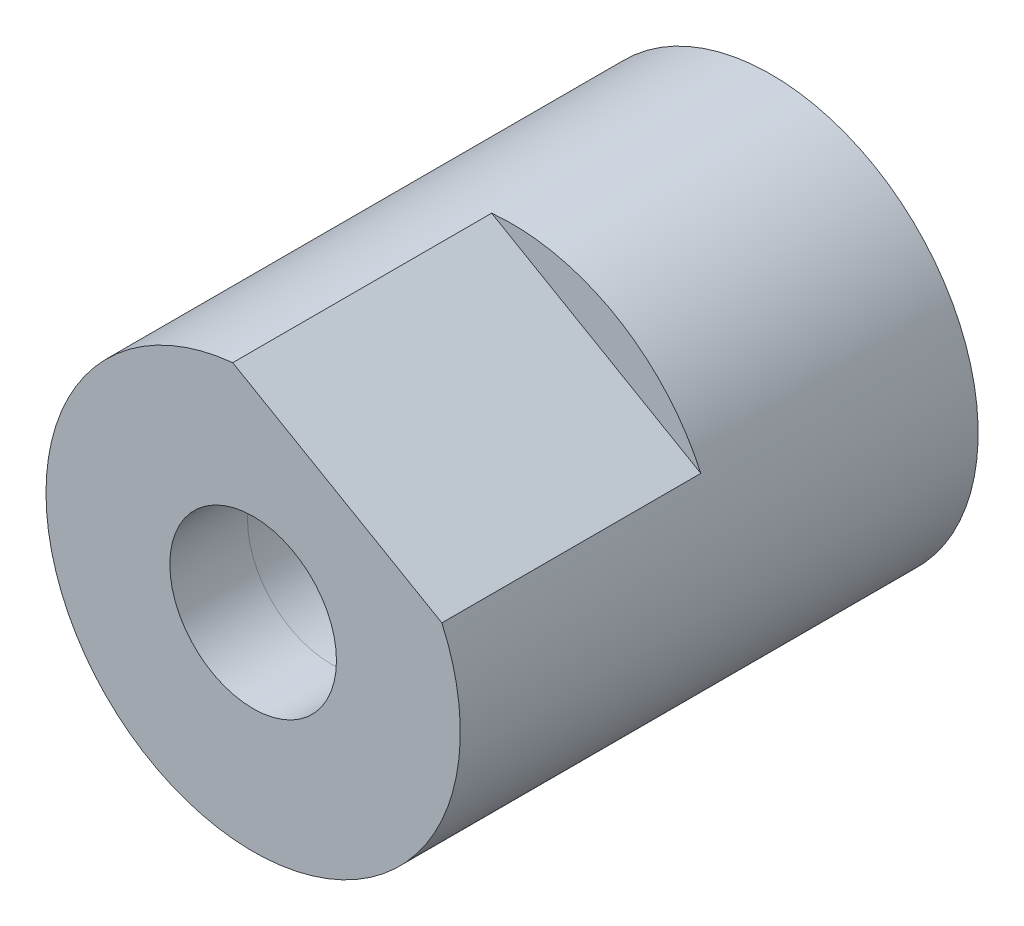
ISO-10303-21;
HEADER;
FILE_DESCRIPTION(('STEP AP214'),'2;1');
FILE_NAME('part.step','',(''),(''),'','','');
FILE_SCHEMA(('AUTOMOTIVE_DESIGN { 1 0 10303 214 1 1 1 1 }'));
ENDSEC;
DATA;
#1=APPLICATION_CONTEXT('core data for automotive mechanical design processes');
#2=APPLICATION_PROTOCOL_DEFINITION('international standard','automotive_design',2000,#1);
#3=PRODUCT_CONTEXT('',#1,'mechanical');
#4=PRODUCT('Part','Part','',(#3));
#5=PRODUCT_RELATED_PRODUCT_CATEGORY('part','',(#4));
#6=PRODUCT_DEFINITION_FORMATION('','',#4);
#7=PRODUCT_DEFINITION_CONTEXT('part definition',#1,'design');
#8=PRODUCT_DEFINITION('design','',#6,#7);
#9=PRODUCT_DEFINITION_SHAPE('','',#8);
#10=(LENGTH_UNIT() NAMED_UNIT(*) SI_UNIT(.MILLI.,.METRE.));
#11=(NAMED_UNIT(*) PLANE_ANGLE_UNIT() SI_UNIT($,.RADIAN.));
#12=(NAMED_UNIT(*) SI_UNIT($,.STERADIAN.) SOLID_ANGLE_UNIT());
#13=UNCERTAINTY_MEASURE_WITH_UNIT(LENGTH_MEASURE(1.E-05),#10,'distance_accuracy_value','');
#14=(GEOMETRIC_REPRESENTATION_CONTEXT(3) GLOBAL_UNCERTAINTY_ASSIGNED_CONTEXT((#13)) GLOBAL_UNIT_ASSIGNED_CONTEXT((#10,
#11,#12)) REPRESENTATION_CONTEXT('',''));
#15=CARTESIAN_POINT('',(0.,0.,0.));
#16=DIRECTION('',(0.,0.,1.));
#17=DIRECTION('',(1.,0.,0.));
#18=AXIS2_PLACEMENT_3D('',#15,#16,#17);
#19=CARTESIAN_POINT('',(-12.7,0.,0.));
#20=DIRECTION('',(0.,0.,1.));
#21=DIRECTION('',(1.,0.,0.));
#22=AXIS2_PLACEMENT_3D('',#19,#20,#21);
#23=PLANE('',#22);
#24=CARTESIAN_POINT('',(0.,0.,0.));
#25=DIRECTION('',(0.,0.,-1.));
#26=DIRECTION('',(-1.,0.,0.));
#27=AXIS2_PLACEMENT_3D('',#24,#25,#26);
#28=CIRCLE('',#27,6.20248949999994);
#29=CARTESIAN_POINT('',(-6.20248949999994,0.,0.));
#30=VERTEX_POINT('',#29);
#31=EDGE_CURVE('E90',#30,#30,#28,.T.);
#32=ORIENTED_EDGE('',*,*,#31,.F.);
#33=EDGE_LOOP('',(#32));
#34=FACE_BOUND('',#33,.T.);
#35=CARTESIAN_POINT('',(0.,0.,0.));
#36=DIRECTION('',(0.,0.,-1.));
#37=DIRECTION('',(-1.,0.,0.));
#38=AXIS2_PLACEMENT_3D('',#35,#36,#37);
#39=CIRCLE('',#38,12.7);
#40=CARTESIAN_POINT('',(-12.7,0.,0.));
#41=VERTEX_POINT('',#40);
#42=EDGE_CURVE('E11',#41,#41,#39,.T.);
#43=ORIENTED_EDGE('',*,*,#42,.T.);
#44=EDGE_LOOP('',(#43));
#45=FACE_BOUND('',#44,.T.);
#46=ADVANCED_FACE('F51',(#34,#45),#23,.F.);
#47=CARTESIAN_POINT('',(0.,0.,-41.5372037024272));
#48=DIRECTION('',(0.,0.,-1.));
#49=DIRECTION('',(-1.,0.,0.));
#50=AXIS2_PLACEMENT_3D('',#47,#48,#49);
#51=CYLINDRICAL_SURFACE('',#50,12.7);
#52=CARTESIAN_POINT('',(0.,0.,31.75));
#53=DIRECTION('',(0.,0.,-1.));
#54=DIRECTION('',(-1.,0.,0.));
#55=AXIS2_PLACEMENT_3D('',#52,#53,#54);
#56=CIRCLE('',#55,12.7);
#57=CARTESIAN_POINT('',(11.5710868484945,5.234496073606,31.75));
#58=VERTEX_POINT('',#57);
#59=CARTESIAN_POINT('',(-1.25233684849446,12.6381031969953,31.75));
#60=VERTEX_POINT('',#59);
#61=EDGE_CURVE('E59',#58,#60,#56,.T.);
#62=ORIENTED_EDGE('',*,*,#61,.T.);
#63=DIRECTION('',(0.,0.,1.));
#64=VECTOR('',#63,1.);
#65=CARTESIAN_POINT('',(-1.25233684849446,12.6381031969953,15.875));
#66=LINE('',#65,#64);
#67=CARTESIAN_POINT('',(-1.25233684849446,12.6381031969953,15.875));
#68=VERTEX_POINT('',#67);
#69=EDGE_CURVE('E66',#68,#60,#66,.T.);
#70=ORIENTED_EDGE('',*,*,#69,.F.);
#71=CARTESIAN_POINT('',(0.,0.,15.875));
#72=DIRECTION('',(0.,0.,1.));
#73=DIRECTION('',(1.,0.,0.));
#74=AXIS2_PLACEMENT_3D('',#71,#72,#73);
#75=CIRCLE('',#74,12.7);
#76=CARTESIAN_POINT('',(11.5710868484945,5.234496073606,15.875));
#77=VERTEX_POINT('',#76);
#78=EDGE_CURVE('E83',#77,#68,#75,.T.);
#79=ORIENTED_EDGE('',*,*,#78,.F.);
#80=DIRECTION('',(0.,0.,1.));
#81=VECTOR('',#80,1.);
#82=CARTESIAN_POINT('',(11.5710868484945,5.234496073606,15.875));
#83=LINE('',#82,#81);
#84=EDGE_CURVE('E72',#77,#58,#83,.T.);
#85=ORIENTED_EDGE('',*,*,#84,.T.);
#86=EDGE_LOOP('',(#62,#70,#79,#85));
#87=FACE_BOUND('',#86,.T.);
#88=ORIENTED_EDGE('',*,*,#42,.F.);
#89=EDGE_LOOP('',(#88));
#90=FACE_BOUND('',#89,.T.);
#91=ADVANCED_FACE('F87',(#87,#90),#51,.T.);
#92=CARTESIAN_POINT('',(-5.10794000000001,0.,31.75));
#93=DIRECTION('',(0.,0.,-1.));
#94=DIRECTION('',(-1.,0.,0.));
#95=AXIS2_PLACEMENT_3D('',#92,#93,#94);
#96=PLANE('',#95);
#97=ORIENTED_EDGE('',*,*,#61,.F.);
#98=DIRECTION('',(0.866025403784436,-0.500000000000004,0.));
#99=VECTOR('',#98,1.);
#100=CARTESIAN_POINT('',(-1.25233684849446,12.6381031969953,31.75));
#101=LINE('',#100,#99);
#102=EDGE_CURVE('E77',#60,#58,#101,.T.);
#103=ORIENTED_EDGE('',*,*,#102,.F.);
#104=EDGE_LOOP('',(#97,#103));
#105=FACE_BOUND('',#104,.T.);
#106=CARTESIAN_POINT('',(0.,0.,31.75));
#107=DIRECTION('',(0.,0.,-1.));
#108=DIRECTION('',(-1.,0.,0.));
#109=AXIS2_PLACEMENT_3D('',#106,#107,#108);
#110=CIRCLE('',#109,5.10794);
#111=CARTESIAN_POINT('',(-5.10794,0.,31.75));
#112=VERTEX_POINT('',#111);
#113=EDGE_CURVE('E95',#112,#112,#110,.T.);
#114=ORIENTED_EDGE('',*,*,#113,.T.);
#115=EDGE_LOOP('',(#114));
#116=FACE_BOUND('',#115,.T.);
#117=ADVANCED_FACE('F92',(#105,#116),#96,.F.);
#118=CARTESIAN_POINT('',(0.,0.,-41.5372037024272));
#119=DIRECTION('',(0.,0.,-1.));
#120=DIRECTION('',(-1.,0.,0.));
#121=AXIS2_PLACEMENT_3D('',#118,#119,#120);
#122=CYLINDRICAL_SURFACE('',#121,5.10794);
#123=ORIENTED_EDGE('',*,*,#113,.F.);
#124=EDGE_LOOP('',(#123));
#125=FACE_BOUND('',#124,.T.);
#126=CARTESIAN_POINT('',(0.,0.,26.9875));
#127=DIRECTION('',(0.,0.,-1.));
#128=DIRECTION('',(-1.,0.,0.));
#129=AXIS2_PLACEMENT_3D('',#126,#127,#128);
#130=CIRCLE('',#129,5.10794);
#131=CARTESIAN_POINT('',(-5.10794,0.,26.9875));
#132=VERTEX_POINT('',#131);
#133=EDGE_CURVE('E100',#132,#132,#130,.T.);
#134=ORIENTED_EDGE('',*,*,#133,.T.);
#135=EDGE_LOOP('',(#134));
#136=FACE_BOUND('',#135,.T.);
#137=ADVANCED_FACE('F134',(#125,#136),#122,.F.);
#138=CARTESIAN_POINT('',(0.,0.,0.));
#139=DIRECTION('',(0.,0.,-1.));
#140=DIRECTION('',(-1.,0.,0.));
#141=AXIS2_PLACEMENT_3D('',#138,#139,#140);
#142=CONICAL_SURFACE('',#141,6.20248949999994,0.040535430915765);
#143=ORIENTED_EDGE('',*,*,#133,.F.);
#144=EDGE_LOOP('',(#143));
#145=FACE_BOUND('',#144,.T.);
#146=ORIENTED_EDGE('',*,*,#31,.T.);
#147=EDGE_LOOP('',(#146));
#148=FACE_BOUND('',#147,.T.);
#149=ADVANCED_FACE('F122',(#145,#148),#142,.F.);
#150=CARTESIAN_POINT('',(-1.25233684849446,12.6381031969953,15.875));
#151=DIRECTION('',(-0.500000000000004,-0.866025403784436,0.));
#152=DIRECTION('',(0.866025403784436,-0.500000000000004,0.));
#153=AXIS2_PLACEMENT_3D('',#150,#151,#152);
#154=PLANE('',#153);
#155=ORIENTED_EDGE('',*,*,#102,.T.);
#156=ORIENTED_EDGE('',*,*,#84,.F.);
#157=DIRECTION('',(0.866025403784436,-0.500000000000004,0.));
#158=VECTOR('',#157,1.);
#159=CARTESIAN_POINT('',(-1.25233684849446,12.6381031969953,15.875));
#160=LINE('',#159,#158);
#161=EDGE_CURVE('E109',#68,#77,#160,.T.);
#162=ORIENTED_EDGE('',*,*,#161,.F.);
#163=ORIENTED_EDGE('',*,*,#69,.T.);
#164=EDGE_LOOP('',(#155,#156,#162,#163));
#165=FACE_BOUND('',#164,.T.);
#166=ADVANCED_FACE('F78',(#165),#154,.F.);
#167=CARTESIAN_POINT('',(0.,0.,15.875));
#168=DIRECTION('',(0.,0.,1.));
#169=DIRECTION('',(1.,0.,0.));
#170=AXIS2_PLACEMENT_3D('',#167,#168,#169);
#171=PLANE('',#170);
#172=ORIENTED_EDGE('',*,*,#78,.T.);
#173=ORIENTED_EDGE('',*,*,#161,.T.);
#174=EDGE_LOOP('',(#172,#173));
#175=FACE_BOUND('',#174,.T.);
#176=ADVANCED_FACE('F116',(#175),#171,.T.);
#177=CLOSED_SHELL('',(#46,#91,#117,#137,#149,#166,#176));
#178=MANIFOLD_SOLID_BREP('B2',#177);
#179=ADVANCED_BREP_SHAPE_REPRESENTATION('',(#18,#178),#14);
#180=SHAPE_DEFINITION_REPRESENTATION(#9,#179);
ENDSEC;
END-ISO-10303-21;
